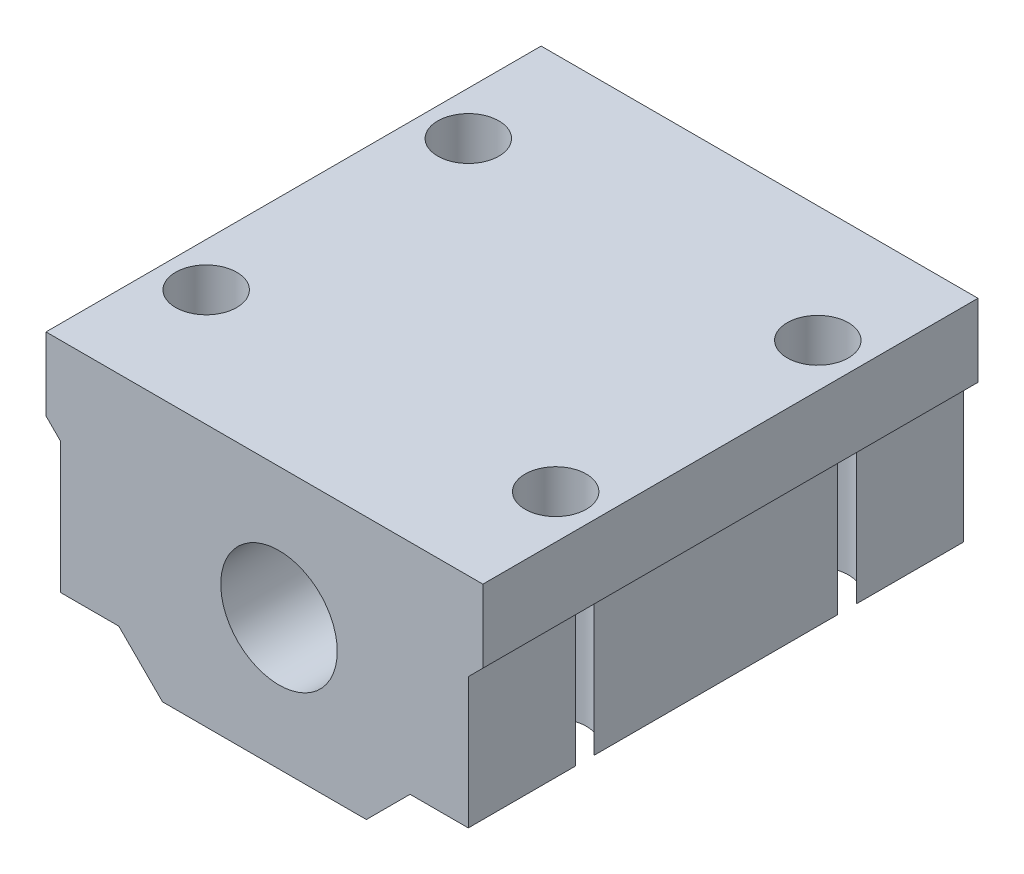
from build123d import *

# Parameters (mm, degrees)
SKETCH_1_R          = 4
EXTRUDE_2_DEPTH     = 34
SKETCH_2_R          = 2.1
CUT_EXTRUDE_1_DEPTH = 42.665333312


with BuildPart() as part:
    # Sketch 1 → Extrude 2 (new body)
    # profile 1 of 2: a face of its own
    with BuildSketch(Plane.XY):
        Polygon((13, 3), (13, -6), (-15, -6), (-15, 3), (-16, 4), (-16, 9), (14, 9), (14, 4), align=None)
        Circle(SKETCH_1_R, mode=Mode.SUBTRACT)
    # profile 2 of 2: a face of its own
    with BuildSketch(Plane.XY):
        Polygon((9, -6), (-11, -6), (-8, -9), (6, -9), align=None)
    extrude(amount=EXTRUDE_2_DEPTH)

    # Sketch 2 → Cut-Extrude 1 (cut, through all)
    with BuildSketch(Plane(origin=(0, 9, 0), x_dir=(1, 0, 0), z_dir=(0, 1, 0))):
        with Locations(Location((-13, -8, 0), (0, 0, 270))):
            Circle(SKETCH_2_R)
        with Locations(Location((-13, -26, 0), (0, 0, 270))):
            Circle(SKETCH_2_R)
        with Locations(Location((11, -8, 0), (0, 0, 270))):
            Circle(SKETCH_2_R)
        with Locations(Location((11, -26, 0), (0, 0, 270))):
            Circle(SKETCH_2_R)
    extrude(amount=-CUT_EXTRUDE_1_DEPTH, mode=Mode.SUBTRACT)


solid = part.part
